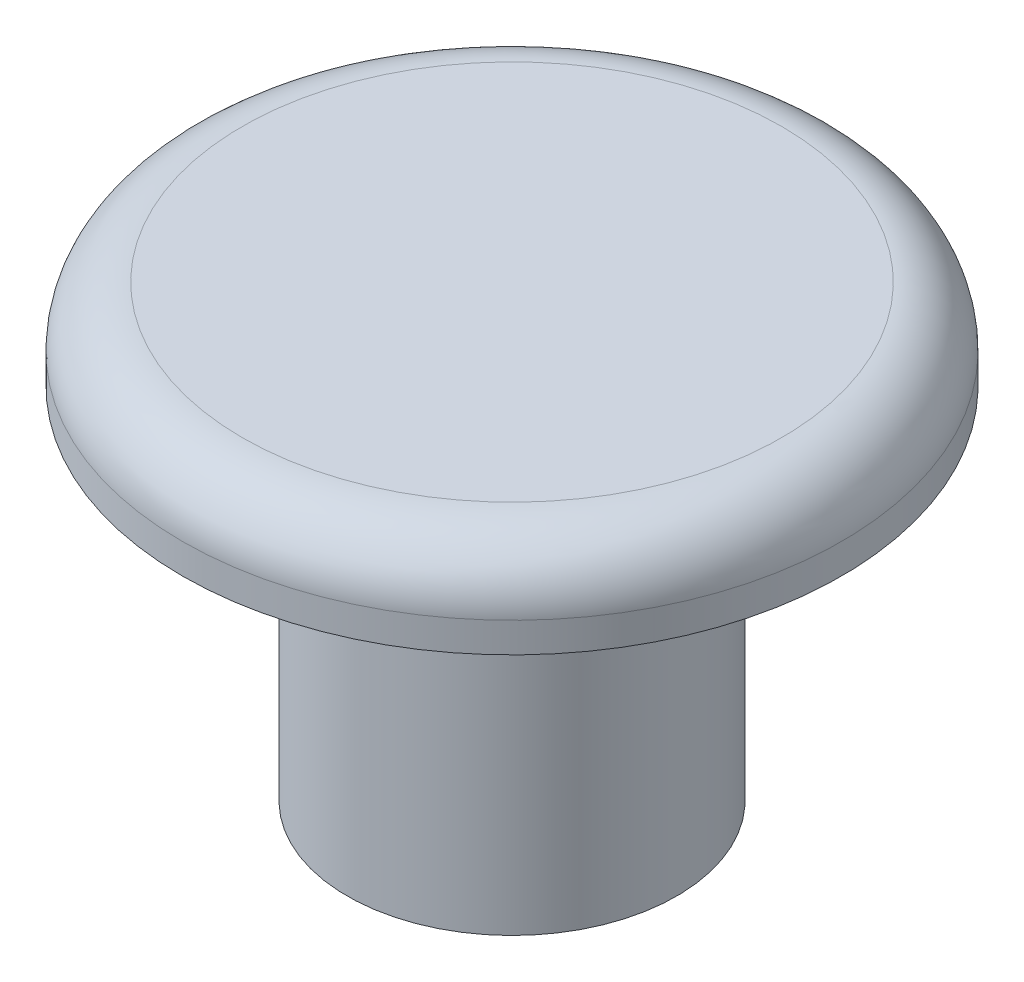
from build123d import *

# Parameters (mm, degrees)
FILLET1_R = 2


with BuildPart() as part:
    # Sketch1 → Revolve1 (revolve)
    with BuildSketch(Plane.XY, mode=Mode.PRIVATE) as revolve1_sk:
        Polygon((0, 0), (5.5, 0), (5.5, 12), (11, 12), (11, 15), (0, 15), align=None)
    revolve(revolve1_sk.sketch.rotate(Axis((0, 0, 0), (0, 1, 0)), 90), axis=Axis((0, 0, 0), (0, 1, 0)))

    # Fillet1
    fillet1_edges = [part.edges().sort_by_distance(p)[0] for p in [
        (0, 15, 11),
    ]]
    fillet(fillet1_edges, radius=FILLET1_R)


solid = part.part
